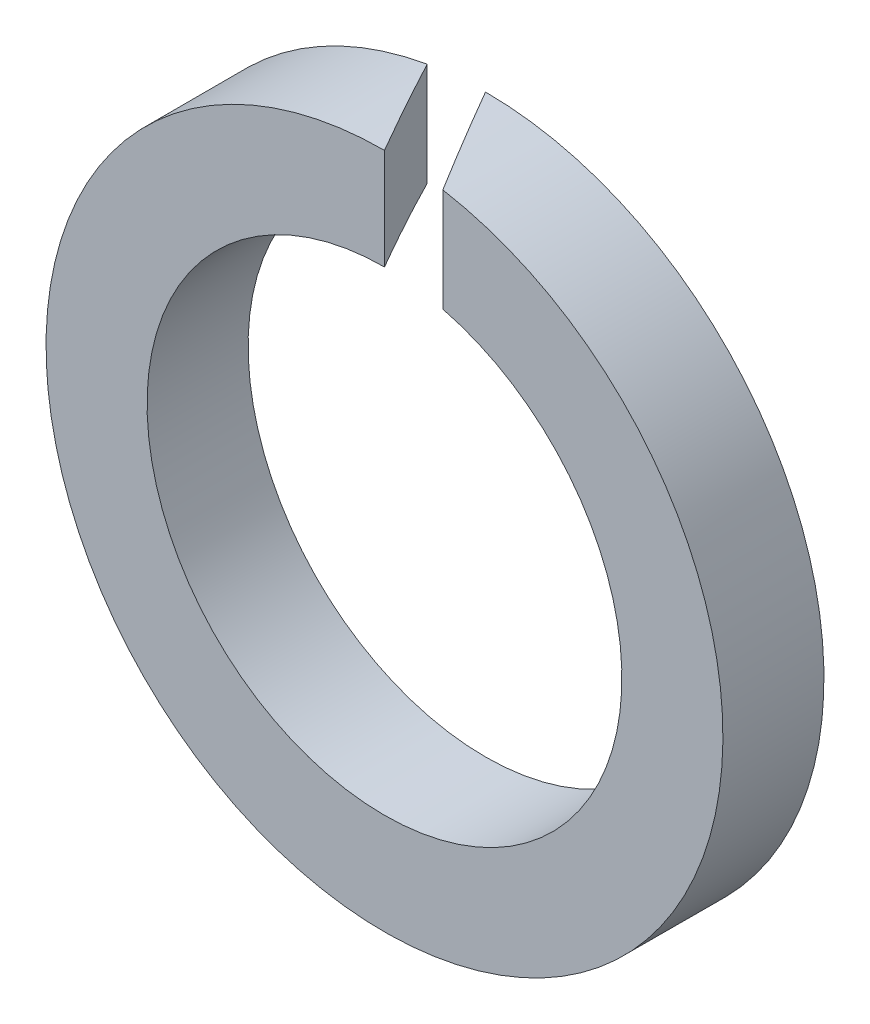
ISO-10303-21;
HEADER;
FILE_DESCRIPTION(('STEP AP214'),'2;1');
FILE_NAME('part.step','',(''),(''),'','','');
FILE_SCHEMA(('AUTOMOTIVE_DESIGN { 1 0 10303 214 1 1 1 1 }'));
ENDSEC;
DATA;
#1=APPLICATION_CONTEXT('core data for automotive mechanical design processes');
#2=APPLICATION_PROTOCOL_DEFINITION('international standard','automotive_design',2000,#1);
#3=PRODUCT_CONTEXT('',#1,'mechanical');
#4=PRODUCT('Part','Part','',(#3));
#5=PRODUCT_RELATED_PRODUCT_CATEGORY('part','',(#4));
#6=PRODUCT_DEFINITION_FORMATION('','',#4);
#7=PRODUCT_DEFINITION_CONTEXT('part definition',#1,'design');
#8=PRODUCT_DEFINITION('design','',#6,#7);
#9=PRODUCT_DEFINITION_SHAPE('','',#8);
#10=(LENGTH_UNIT() NAMED_UNIT(*) SI_UNIT(.MILLI.,.METRE.));
#11=(NAMED_UNIT(*) PLANE_ANGLE_UNIT() SI_UNIT($,.RADIAN.));
#12=(NAMED_UNIT(*) SI_UNIT($,.STERADIAN.) SOLID_ANGLE_UNIT());
#13=UNCERTAINTY_MEASURE_WITH_UNIT(LENGTH_MEASURE(1.E-05),#10,'distance_accuracy_value','');
#14=(GEOMETRIC_REPRESENTATION_CONTEXT(3) GLOBAL_UNCERTAINTY_ASSIGNED_CONTEXT((#13)) GLOBAL_UNIT_ASSIGNED_CONTEXT((#10,
#11,#12)) REPRESENTATION_CONTEXT('',''));
#15=CARTESIAN_POINT('',(0.,0.,0.));
#16=DIRECTION('',(0.,0.,1.));
#17=DIRECTION('',(1.,0.,0.));
#18=AXIS2_PLACEMENT_3D('',#15,#16,#17);
#19=CARTESIAN_POINT('',(0.,0.,-0.5));
#20=DIRECTION('',(0.,0.,1.));
#21=DIRECTION('',(1.,0.,0.));
#22=AXIS2_PLACEMENT_3D('',#19,#20,#21);
#23=CYLINDRICAL_SURFACE('',#22,1.675);
#24=CARTESIAN_POINT('',(0.,0.,0.));
#25=DIRECTION('',(0.,0.,1.));
#26=DIRECTION('',(1.,0.,0.));
#27=AXIS2_PLACEMENT_3D('',#24,#25,#26);
#28=CIRCLE('',#27,1.675);
#29=CARTESIAN_POINT('',(0.,1.675,0.));
#30=VERTEX_POINT('',#29);
#31=CARTESIAN_POINT('',(0.288675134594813,1.64993686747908,0.));
#32=VERTEX_POINT('',#31);
#33=EDGE_CURVE('E83',#30,#32,#28,.T.);
#34=ORIENTED_EDGE('',*,*,#33,.F.);
#35=CARTESIAN_POINT('',(0.,0.,0.));
#36=DIRECTION('',(0.866025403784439,0.,-0.5));
#37=DIRECTION('',(0.5,0.,0.866025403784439));
#38=AXIS2_PLACEMENT_3D('',#35,#36,#37);
#39=ELLIPSE('',#38,3.35,1.675);
#40=CARTESIAN_POINT('',(-0.288675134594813,1.64993686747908,-0.5));
#41=VERTEX_POINT('',#40);
#42=EDGE_CURVE('E67',#30,#41,#39,.F.);
#43=ORIENTED_EDGE('',*,*,#42,.T.);
#44=CARTESIAN_POINT('',(0.,0.,-0.5));
#45=DIRECTION('',(0.,0.,1.));
#46=DIRECTION('',(1.,0.,0.));
#47=AXIS2_PLACEMENT_3D('',#44,#45,#46);
#48=CIRCLE('',#47,1.675);
#49=CARTESIAN_POINT('',(0.,1.675,-0.5));
#50=VERTEX_POINT('',#49);
#51=EDGE_CURVE('E88',#41,#50,#48,.T.);
#52=ORIENTED_EDGE('',*,*,#51,.T.);
#53=CARTESIAN_POINT('',(0.,0.,-0.5));
#54=DIRECTION('',(-0.866025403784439,0.,0.5));
#55=DIRECTION('',(0.5,0.,0.866025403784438));
#56=AXIS2_PLACEMENT_3D('',#53,#54,#55);
#57=ELLIPSE('',#56,3.35,1.675);
#58=EDGE_CURVE('E76',#50,#32,#57,.F.);
#59=ORIENTED_EDGE('',*,*,#58,.T.);
#60=EDGE_LOOP('',(#34,#43,#52,#59));
#61=FACE_BOUND('',#60,.T.);
#62=ADVANCED_FACE('F30',(#61),#23,.T.);
#63=CARTESIAN_POINT('',(0.,0.,-0.5));
#64=DIRECTION('',(0.,0.,1.));
#65=DIRECTION('',(1.,0.,0.));
#66=AXIS2_PLACEMENT_3D('',#63,#64,#65);
#67=PLANE('',#66);
#68=DIRECTION('',(0.,-1.,0.));
#69=VECTOR('',#68,1.);
#70=CARTESIAN_POINT('',(-0.288675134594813,1.675,-0.5));
#71=LINE('',#70,#69);
#72=CARTESIAN_POINT('',(-0.288675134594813,1.1389871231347,-0.5));
#73=VERTEX_POINT('',#72);
#74=EDGE_CURVE('E70',#41,#73,#71,.T.);
#75=ORIENTED_EDGE('',*,*,#74,.T.);
#76=CARTESIAN_POINT('',(0.,0.,-0.5));
#77=DIRECTION('',(0.,0.,1.));
#78=DIRECTION('',(1.,0.,0.));
#79=AXIS2_PLACEMENT_3D('',#76,#77,#78);
#80=CIRCLE('',#79,1.175);
#81=CARTESIAN_POINT('',(0.,1.175,-0.5));
#82=VERTEX_POINT('',#81);
#83=EDGE_CURVE('E89',#73,#82,#80,.T.);
#84=ORIENTED_EDGE('',*,*,#83,.T.);
#85=DIRECTION('',(0.,-1.,0.));
#86=VECTOR('',#85,1.);
#87=CARTESIAN_POINT('',(0.,1.675,-0.5));
#88=LINE('',#87,#86);
#89=EDGE_CURVE('E51',#50,#82,#88,.T.);
#90=ORIENTED_EDGE('',*,*,#89,.F.);
#91=ORIENTED_EDGE('',*,*,#51,.F.);
#92=EDGE_LOOP('',(#75,#84,#90,#91));
#93=FACE_BOUND('',#92,.T.);
#94=ADVANCED_FACE('F104',(#93),#67,.F.);
#95=CARTESIAN_POINT('',(0.,0.,0.));
#96=DIRECTION('',(0.,0.,1.));
#97=DIRECTION('',(1.,0.,0.));
#98=AXIS2_PLACEMENT_3D('',#95,#96,#97);
#99=PLANE('',#98);
#100=CARTESIAN_POINT('',(0.,0.,0.));
#101=DIRECTION('',(0.,0.,1.));
#102=DIRECTION('',(1.,0.,0.));
#103=AXIS2_PLACEMENT_3D('',#100,#101,#102);
#104=CIRCLE('',#103,1.175);
#105=CARTESIAN_POINT('',(0.,1.175,0.));
#106=VERTEX_POINT('',#105);
#107=CARTESIAN_POINT('',(0.288675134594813,1.1389871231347,0.));
#108=VERTEX_POINT('',#107);
#109=EDGE_CURVE('E75',#106,#108,#104,.T.);
#110=ORIENTED_EDGE('',*,*,#109,.F.);
#111=DIRECTION('',(0.,-1.,0.));
#112=VECTOR('',#111,1.);
#113=CARTESIAN_POINT('',(0.,1.675,0.));
#114=LINE('',#113,#112);
#115=EDGE_CURVE('E43',#30,#106,#114,.T.);
#116=ORIENTED_EDGE('',*,*,#115,.F.);
#117=ORIENTED_EDGE('',*,*,#33,.T.);
#118=DIRECTION('',(0.,-1.,0.));
#119=VECTOR('',#118,1.);
#120=CARTESIAN_POINT('',(0.288675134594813,1.675,0.));
#121=LINE('',#120,#119);
#122=EDGE_CURVE('E85',#32,#108,#121,.T.);
#123=ORIENTED_EDGE('',*,*,#122,.T.);
#124=EDGE_LOOP('',(#110,#116,#117,#123));
#125=FACE_BOUND('',#124,.T.);
#126=ADVANCED_FACE('F81',(#125),#99,.T.);
#127=CARTESIAN_POINT('',(0.,0.,-0.5));
#128=DIRECTION('',(0.,0.,1.));
#129=DIRECTION('',(1.,0.,0.));
#130=AXIS2_PLACEMENT_3D('',#127,#128,#129);
#131=CYLINDRICAL_SURFACE('',#130,1.175);
#132=CARTESIAN_POINT('',(0.,0.,0.));
#133=DIRECTION('',(0.866025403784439,0.,-0.5));
#134=DIRECTION('',(0.5,0.,0.866025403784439));
#135=AXIS2_PLACEMENT_3D('',#132,#133,#134);
#136=ELLIPSE('',#135,2.35,1.175);
#137=EDGE_CURVE('E11',#106,#73,#136,.F.);
#138=ORIENTED_EDGE('',*,*,#137,.F.);
#139=ORIENTED_EDGE('',*,*,#109,.T.);
#140=CARTESIAN_POINT('',(0.,0.,-0.5));
#141=DIRECTION('',(-0.866025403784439,0.,0.5));
#142=DIRECTION('',(0.5,0.,0.866025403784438));
#143=AXIS2_PLACEMENT_3D('',#140,#141,#142);
#144=ELLIPSE('',#143,2.35,1.175);
#145=EDGE_CURVE('E37',#82,#108,#144,.F.);
#146=ORIENTED_EDGE('',*,*,#145,.F.);
#147=ORIENTED_EDGE('',*,*,#83,.F.);
#148=EDGE_LOOP('',(#138,#139,#146,#147));
#149=FACE_BOUND('',#148,.T.);
#150=ADVANCED_FACE('F99',(#149),#131,.F.);
#151=CARTESIAN_POINT('',(0.,1.675,-0.5));
#152=DIRECTION('',(-0.866025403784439,0.,0.5));
#153=DIRECTION('',(0.5,0.,0.866025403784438));
#154=AXIS2_PLACEMENT_3D('',#151,#152,#153);
#155=PLANE('',#154);
#156=ORIENTED_EDGE('',*,*,#89,.T.);
#157=ORIENTED_EDGE('',*,*,#145,.T.);
#158=ORIENTED_EDGE('',*,*,#122,.F.);
#159=ORIENTED_EDGE('',*,*,#58,.F.);
#160=EDGE_LOOP('',(#156,#157,#158,#159));
#161=FACE_BOUND('',#160,.T.);
#162=ADVANCED_FACE('F95',(#161),#155,.T.);
#163=CARTESIAN_POINT('',(0.,1.675,0.));
#164=DIRECTION('',(0.866025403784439,0.,-0.5));
#165=DIRECTION('',(-0.5,0.,-0.866025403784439));
#166=AXIS2_PLACEMENT_3D('',#163,#164,#165);
#167=PLANE('',#166);
#168=ORIENTED_EDGE('',*,*,#115,.T.);
#169=ORIENTED_EDGE('',*,*,#137,.T.);
#170=ORIENTED_EDGE('',*,*,#74,.F.);
#171=ORIENTED_EDGE('',*,*,#42,.F.);
#172=EDGE_LOOP('',(#168,#169,#170,#171));
#173=FACE_BOUND('',#172,.T.);
#174=ADVANCED_FACE('F68',(#173),#167,.T.);
#175=CLOSED_SHELL('',(#62,#94,#126,#150,#162,#174));
#176=MANIFOLD_SOLID_BREP('B2',#175);
#177=ADVANCED_BREP_SHAPE_REPRESENTATION('',(#18,#176),#14);
#178=SHAPE_DEFINITION_REPRESENTATION(#9,#177);
ENDSEC;
END-ISO-10303-21;
